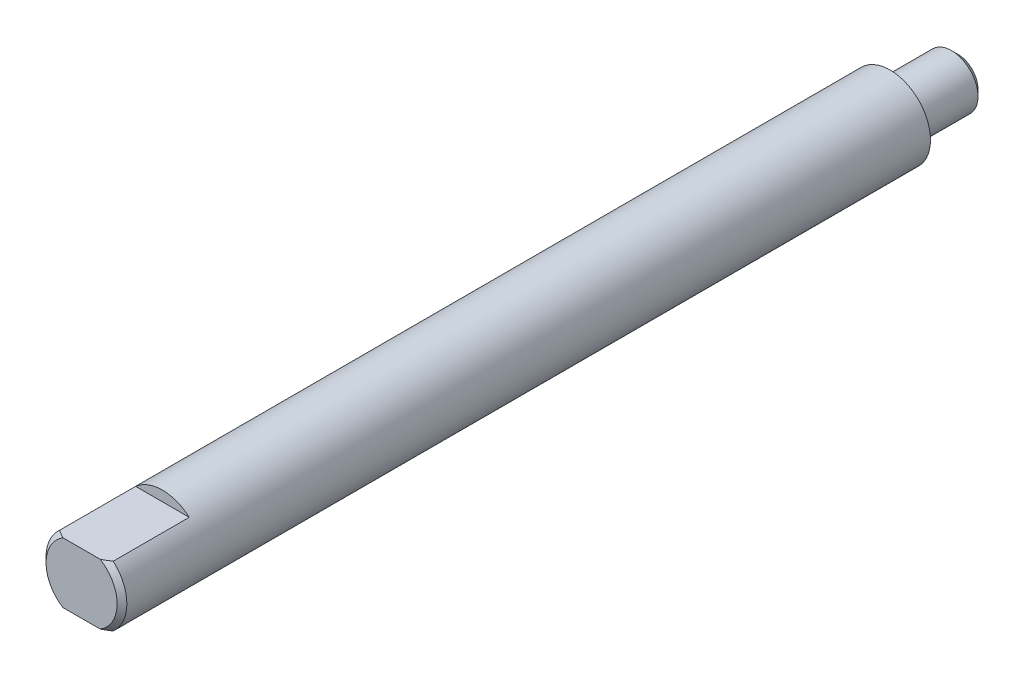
from build123d import *

# Parameters (mm, degrees)
SKETCH2_W          = 6.35
SKETCH2_H          = 0.8
CUT_EXTRUDE1_DEPTH = 5


with BuildPart() as part:
    # Sketch1 → Revolve1 (revolve)
    with BuildSketch(Plane(origin=(0, 0, 0), x_dir=(0, 0, -1), z_dir=(1, 0, 0)), mode=Mode.PRIVATE) as revolve1_sk:
        Polygon((64.77, 1.57), (64.26, 2.0828), (59.436, 2.0828), (59.436, 3.175), (-3.684, 3.175), (-4.064, 2.79), (-4.064, 0), (64.77, 0), align=None)
    revolve(revolve1_sk.sketch.rotate(Axis((0, 0, 4.064), (0, 0, -1)), 180), axis=Axis((0, 0, 4.064), (0, 0, -1)))

    # Sketch2 → Cut-Extrude1 (cut, symmetric)
    with BuildSketch(Plane(origin=(0, 0, 0), x_dir=(0, 0, -1), z_dir=(1, 0, 0))):
        with Locations((-0.889, 2.775)):
            Rectangle(SKETCH2_W, SKETCH2_H)
        with Locations((-0.889, -2.775)):
            Rectangle(SKETCH2_W, SKETCH2_H)
    extrude(amount=CUT_EXTRUDE1_DEPTH, both=True, mode=Mode.SUBTRACT)


solid = part.part
